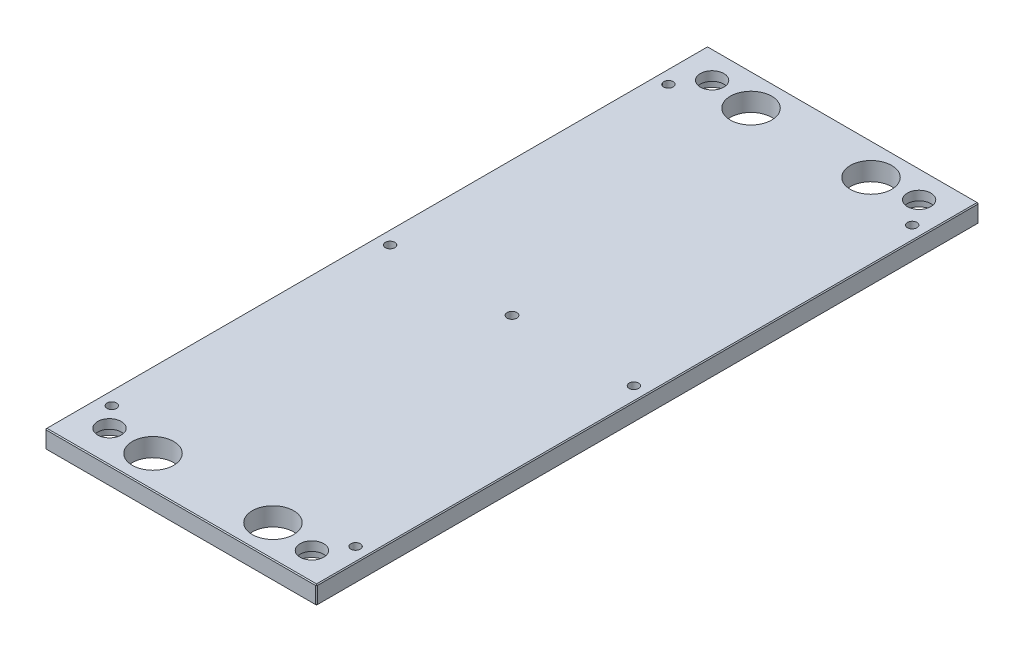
ISO-10303-21;
HEADER;
FILE_DESCRIPTION(('STEP AP214'),'2;1');
FILE_NAME('part.step','',(''),(''),'','','');
FILE_SCHEMA(('AUTOMOTIVE_DESIGN { 1 0 10303 214 1 1 1 1 }'));
ENDSEC;
DATA;
#1=APPLICATION_CONTEXT('core data for automotive mechanical design processes');
#2=APPLICATION_PROTOCOL_DEFINITION('international standard','automotive_design',2000,#1);
#3=PRODUCT_CONTEXT('',#1,'mechanical');
#4=PRODUCT('Part','Part','',(#3));
#5=PRODUCT_RELATED_PRODUCT_CATEGORY('part','',(#4));
#6=PRODUCT_DEFINITION_FORMATION('','',#4);
#7=PRODUCT_DEFINITION_CONTEXT('part definition',#1,'design');
#8=PRODUCT_DEFINITION('design','',#6,#7);
#9=PRODUCT_DEFINITION_SHAPE('','',#8);
#10=(LENGTH_UNIT() NAMED_UNIT(*) SI_UNIT(.MILLI.,.METRE.));
#11=(NAMED_UNIT(*) PLANE_ANGLE_UNIT() SI_UNIT($,.RADIAN.));
#12=(NAMED_UNIT(*) SI_UNIT($,.STERADIAN.) SOLID_ANGLE_UNIT());
#13=UNCERTAINTY_MEASURE_WITH_UNIT(LENGTH_MEASURE(1.E-05),#10,'distance_accuracy_value','');
#14=(GEOMETRIC_REPRESENTATION_CONTEXT(3) GLOBAL_UNCERTAINTY_ASSIGNED_CONTEXT((#13)) GLOBAL_UNIT_ASSIGNED_CONTEXT((#10,
#11,#12)) REPRESENTATION_CONTEXT('',''));
#15=CARTESIAN_POINT('',(0.,0.,0.));
#16=DIRECTION('',(0.,0.,1.));
#17=DIRECTION('',(1.,0.,0.));
#18=AXIS2_PLACEMENT_3D('',#15,#16,#17);
#19=CARTESIAN_POINT('',(-93.6625,-12.7,228.6));
#20=DIRECTION('',(0.,1.,0.));
#21=DIRECTION('',(-1.,0.,0.));
#22=AXIS2_PLACEMENT_3D('',#19,#20,#21);
#23=PLANE('',#22);
#24=CARTESIAN_POINT('',(-84.1375,-12.7000000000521,0.));
#25=DIRECTION('',(0.,1.,0.));
#26=DIRECTION('',(-1.,0.,0.));
#27=AXIS2_PLACEMENT_3D('',#24,#25,#26);
#28=CIRCLE('',#27,3.26389999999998);
#29=CARTESIAN_POINT('',(-87.4014,-12.7000000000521,0.));
#30=VERTEX_POINT('',#29);
#31=EDGE_CURVE('E900',#30,#30,#28,.T.);
#32=ORIENTED_EDGE('',*,*,#31,.F.);
#33=EDGE_LOOP('',(#32));
#34=FACE_BOUND('',#33,.T.);
#35=CARTESIAN_POINT('',(84.1375,-12.6999999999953,0.));
#36=DIRECTION('',(0.,1.,0.));
#37=DIRECTION('',(-1.,0.,0.));
#38=AXIS2_PLACEMENT_3D('',#35,#36,#37);
#39=CIRCLE('',#38,3.26389999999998);
#40=CARTESIAN_POINT('',(80.8736,-12.6999999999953,0.));
#41=VERTEX_POINT('',#40);
#42=EDGE_CURVE('E902',#41,#41,#39,.T.);
#43=ORIENTED_EDGE('',*,*,#42,.F.);
#44=EDGE_LOOP('',(#43));
#45=FACE_BOUND('',#44,.T.);
#46=CARTESIAN_POINT('',(-41.402,-12.6999999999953,-206.375));
#47=DIRECTION('',(0.,1.,0.));
#48=DIRECTION('',(-1.,0.,0.));
#49=AXIS2_PLACEMENT_3D('',#46,#47,#48);
#50=CIRCLE('',#49,14.2875);
#51=CARTESIAN_POINT('',(-55.6895,-12.6999999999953,-206.375));
#52=VERTEX_POINT('',#51);
#53=EDGE_CURVE('E908',#52,#52,#50,.T.);
#54=ORIENTED_EDGE('',*,*,#53,.F.);
#55=EDGE_LOOP('',(#54));
#56=FACE_BOUND('',#55,.T.);
#57=CARTESIAN_POINT('',(-41.402,-12.7000000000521,206.375));
#58=DIRECTION('',(0.,1.,0.));
#59=DIRECTION('',(-1.,0.,0.));
#60=AXIS2_PLACEMENT_3D('',#57,#58,#59);
#61=CIRCLE('',#60,14.2875);
#62=CARTESIAN_POINT('',(-55.6895,-12.7000000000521,206.375));
#63=VERTEX_POINT('',#62);
#64=EDGE_CURVE('E914',#63,#63,#61,.T.);
#65=ORIENTED_EDGE('',*,*,#64,.F.);
#66=EDGE_LOOP('',(#65));
#67=FACE_BOUND('',#66,.T.);
#68=CARTESIAN_POINT('',(41.402,-12.7000000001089,206.375));
#69=DIRECTION('',(0.,1.,0.));
#70=DIRECTION('',(-1.,0.,0.));
#71=AXIS2_PLACEMENT_3D('',#68,#69,#70);
#72=CIRCLE('',#71,14.2875);
#73=CARTESIAN_POINT('',(27.1145,-12.7000000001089,206.375));
#74=VERTEX_POINT('',#73);
#75=EDGE_CURVE('E920',#74,#74,#72,.T.);
#76=ORIENTED_EDGE('',*,*,#75,.F.);
#77=EDGE_LOOP('',(#76));
#78=FACE_BOUND('',#77,.T.);
#79=CARTESIAN_POINT('',(41.402,-12.7,-206.375));
#80=DIRECTION('',(0.,1.,0.));
#81=DIRECTION('',(-1.,0.,0.));
#82=AXIS2_PLACEMENT_3D('',#79,#80,#81);
#83=CIRCLE('',#82,14.2875);
#84=CARTESIAN_POINT('',(27.1144999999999,-12.7,-206.375));
#85=VERTEX_POINT('',#84);
#86=EDGE_CURVE('E926',#85,#85,#83,.T.);
#87=ORIENTED_EDGE('',*,*,#86,.F.);
#88=EDGE_LOOP('',(#87));
#89=FACE_BOUND('',#88,.T.);
#90=DIRECTION('',(0.,0.,-1.));
#91=VECTOR('',#90,1.);
#92=CARTESIAN_POINT('',(93.0275,-12.7,-228.6));
#93=LINE('',#92,#91);
#94=CARTESIAN_POINT('',(93.0275,-12.7,227.965));
#95=VERTEX_POINT('',#94);
#96=CARTESIAN_POINT('',(93.0275,-12.7,-227.965));
#97=VERTEX_POINT('',#96);
#98=EDGE_CURVE('E184',#95,#97,#93,.T.);
#99=ORIENTED_EDGE('',*,*,#98,.T.);
#100=DIRECTION('',(-1.,0.,0.));
#101=VECTOR('',#100,1.);
#102=CARTESIAN_POINT('',(-93.6625,-12.7,-227.965));
#103=LINE('',#102,#101);
#104=CARTESIAN_POINT('',(-93.0275,-12.7,-227.965));
#105=VERTEX_POINT('',#104);
#106=EDGE_CURVE('E146',#97,#105,#103,.T.);
#107=ORIENTED_EDGE('',*,*,#106,.T.);
#108=DIRECTION('',(0.,0.,1.));
#109=VECTOR('',#108,1.);
#110=CARTESIAN_POINT('',(-93.0275,-12.7,228.6));
#111=LINE('',#110,#109);
#112=CARTESIAN_POINT('',(-93.0275,-12.7,227.965));
#113=VERTEX_POINT('',#112);
#114=EDGE_CURVE('E186',#105,#113,#111,.T.);
#115=ORIENTED_EDGE('',*,*,#114,.T.);
#116=DIRECTION('',(1.,0.,0.));
#117=VECTOR('',#116,1.);
#118=CARTESIAN_POINT('',(-93.6625,-12.7,227.965));
#119=LINE('',#118,#117);
#120=EDGE_CURVE('E182',#113,#95,#119,.T.);
#121=ORIENTED_EDGE('',*,*,#120,.T.);
#122=EDGE_LOOP('',(#99,#107,#115,#121));
#123=FACE_BOUND('',#122,.T.);
#124=CARTESIAN_POINT('',(-84.1375,-12.6999999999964,-192.0875));
#125=DIRECTION('',(0.,1.,0.));
#126=DIRECTION('',(-1.,0.,0.));
#127=AXIS2_PLACEMENT_3D('',#124,#125,#126);
#128=CIRCLE('',#127,3.26390000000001);
#129=CARTESIAN_POINT('',(-87.4014,-12.6999999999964,-192.0875));
#130=VERTEX_POINT('',#129);
#131=EDGE_CURVE('E267',#130,#130,#128,.T.);
#132=ORIENTED_EDGE('',*,*,#131,.F.);
#133=EDGE_LOOP('',(#132));
#134=FACE_BOUND('',#133,.T.);
#135=CARTESIAN_POINT('',(-84.1375,-12.7000000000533,192.0875));
#136=DIRECTION('',(0.,1.,0.));
#137=DIRECTION('',(-1.,0.,0.));
#138=AXIS2_PLACEMENT_3D('',#135,#136,#137);
#139=CIRCLE('',#138,3.26389999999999);
#140=CARTESIAN_POINT('',(-87.4014,-12.7000000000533,192.0875));
#141=VERTEX_POINT('',#140);
#142=EDGE_CURVE('E278',#141,#141,#139,.T.);
#143=ORIENTED_EDGE('',*,*,#142,.F.);
#144=EDGE_LOOP('',(#143));
#145=FACE_BOUND('',#144,.T.);
#146=CARTESIAN_POINT('',(84.1375,-12.6999999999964,192.0875));
#147=DIRECTION('',(0.,1.,0.));
#148=DIRECTION('',(-1.,0.,0.));
#149=AXIS2_PLACEMENT_3D('',#146,#147,#148);
#150=CIRCLE('',#149,3.26390000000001);
#151=CARTESIAN_POINT('',(80.8736,-12.6999999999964,192.0875));
#152=VERTEX_POINT('',#151);
#153=EDGE_CURVE('E285',#152,#152,#150,.T.);
#154=ORIENTED_EDGE('',*,*,#153,.F.);
#155=EDGE_LOOP('',(#154));
#156=FACE_BOUND('',#155,.T.);
#157=CARTESIAN_POINT('',(84.1375,-12.7,-192.0875));
#158=DIRECTION('',(0.,1.,0.));
#159=DIRECTION('',(-1.,0.,0.));
#160=AXIS2_PLACEMENT_3D('',#157,#158,#159);
#161=CIRCLE('',#160,3.26389999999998);
#162=CARTESIAN_POINT('',(80.8736,-12.7,-192.0875));
#163=VERTEX_POINT('',#162);
#164=EDGE_CURVE('E291',#163,#163,#161,.T.);
#165=ORIENTED_EDGE('',*,*,#164,.F.);
#166=EDGE_LOOP('',(#165));
#167=FACE_BOUND('',#166,.T.);
#168=CARTESIAN_POINT('',(-71.4375,-12.6999999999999,-209.55));
#169=DIRECTION('',(0.,-1.,0.));
#170=DIRECTION('',(0.,0.,-1.));
#171=AXIS2_PLACEMENT_3D('',#168,#169,#170);
#172=CIRCLE('',#171,8.13593749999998);
#173=CARTESIAN_POINT('',(-71.4375,-12.6999999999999,-217.6859375));
#174=VERTEX_POINT('',#173);
#175=EDGE_CURVE('E311',#174,#174,#172,.T.);
#176=ORIENTED_EDGE('',*,*,#175,.T.);
#177=EDGE_LOOP('',(#176));
#178=FACE_BOUND('',#177,.T.);
#179=CARTESIAN_POINT('',(71.4375,-12.7,209.55));
#180=DIRECTION('',(0.,-1.,0.));
#181=DIRECTION('',(0.,0.,-1.));
#182=AXIS2_PLACEMENT_3D('',#179,#180,#181);
#183=CIRCLE('',#182,8.13593749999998);
#184=CARTESIAN_POINT('',(71.4375,-12.7,201.4140625));
#185=VERTEX_POINT('',#184);
#186=EDGE_CURVE('E335',#185,#185,#183,.T.);
#187=ORIENTED_EDGE('',*,*,#186,.T.);
#188=EDGE_LOOP('',(#187));
#189=FACE_BOUND('',#188,.T.);
#190=CARTESIAN_POINT('',(71.4375,-12.7,-209.55));
#191=DIRECTION('',(0.,-1.,0.));
#192=DIRECTION('',(0.,0.,-1.));
#193=AXIS2_PLACEMENT_3D('',#190,#191,#192);
#194=CIRCLE('',#193,8.13593749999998);
#195=CARTESIAN_POINT('',(71.4375,-12.7,-217.6859375));
#196=VERTEX_POINT('',#195);
#197=EDGE_CURVE('E347',#196,#196,#194,.T.);
#198=ORIENTED_EDGE('',*,*,#197,.T.);
#199=EDGE_LOOP('',(#198));
#200=FACE_BOUND('',#199,.T.);
#201=CARTESIAN_POINT('',(-71.4375,-12.6999999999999,206.375));
#202=DIRECTION('',(0.,-1.,0.));
#203=DIRECTION('',(0.,0.,-1.));
#204=AXIS2_PLACEMENT_3D('',#201,#202,#203);
#205=CIRCLE('',#204,8.13593749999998);
#206=CARTESIAN_POINT('',(-71.4375,-12.6999999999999,198.2390625));
#207=VERTEX_POINT('',#206);
#208=EDGE_CURVE('E323',#207,#207,#205,.T.);
#209=ORIENTED_EDGE('',*,*,#208,.T.);
#210=EDGE_LOOP('',(#209));
#211=FACE_BOUND('',#210,.T.);
#212=CARTESIAN_POINT('',(0.,-12.6999999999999,0.));
#213=DIRECTION('',(0.,-1.,0.));
#214=DIRECTION('',(0.,0.,-1.));
#215=AXIS2_PLACEMENT_3D('',#212,#213,#214);
#216=CIRCLE('',#215,3.37343749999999);
#217=CARTESIAN_POINT('',(0.,-12.6999999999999,-3.37343749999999));
#218=VERTEX_POINT('',#217);
#219=EDGE_CURVE('E297',#218,#218,#216,.T.);
#220=ORIENTED_EDGE('',*,*,#219,.T.);
#221=EDGE_LOOP('',(#220));
#222=FACE_BOUND('',#221,.T.);
#223=ADVANCED_FACE('F39',(#34,#45,#56,#67,#78,#89,#123,#134,#145,#156,#167,#178,#189,#200,#211,
#222),#23,.T.);
#224=CARTESIAN_POINT('',(93.6625,-25.4,228.6));
#225=DIRECTION('',(0.,-1.,0.));
#226=DIRECTION('',(1.,0.,0.));
#227=AXIS2_PLACEMENT_3D('',#224,#225,#226);
#228=PLANE('',#227);
#229=CARTESIAN_POINT('',(-84.1375,-25.4,0.));
#230=DIRECTION('',(0.,1.,0.));
#231=DIRECTION('',(-1.,0.,0.));
#232=AXIS2_PLACEMENT_3D('',#229,#230,#231);
#233=CIRCLE('',#232,3.26389999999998);
#234=CARTESIAN_POINT('',(-87.4014,-25.4,0.));
#235=VERTEX_POINT('',#234);
#236=EDGE_CURVE('E898',#235,#235,#233,.T.);
#237=ORIENTED_EDGE('',*,*,#236,.T.);
#238=EDGE_LOOP('',(#237));
#239=FACE_BOUND('',#238,.T.);
#240=CARTESIAN_POINT('',(84.1375,-25.4,0.));
#241=DIRECTION('',(0.,1.,0.));
#242=DIRECTION('',(-1.,0.,0.));
#243=AXIS2_PLACEMENT_3D('',#240,#241,#242);
#244=CIRCLE('',#243,3.26389999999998);
#245=CARTESIAN_POINT('',(80.8736,-25.4,0.));
#246=VERTEX_POINT('',#245);
#247=EDGE_CURVE('E905',#246,#246,#244,.T.);
#248=ORIENTED_EDGE('',*,*,#247,.T.);
#249=EDGE_LOOP('',(#248));
#250=FACE_BOUND('',#249,.T.);
#251=CARTESIAN_POINT('',(-41.402,-25.4,-206.375));
#252=DIRECTION('',(0.,1.,0.));
#253=DIRECTION('',(-1.,0.,0.));
#254=AXIS2_PLACEMENT_3D('',#251,#252,#253);
#255=CIRCLE('',#254,14.2875);
#256=CARTESIAN_POINT('',(-55.6895,-25.4,-206.375));
#257=VERTEX_POINT('',#256);
#258=EDGE_CURVE('E911',#257,#257,#255,.T.);
#259=ORIENTED_EDGE('',*,*,#258,.T.);
#260=EDGE_LOOP('',(#259));
#261=FACE_BOUND('',#260,.T.);
#262=CARTESIAN_POINT('',(-41.402,-25.4,206.375));
#263=DIRECTION('',(0.,1.,0.));
#264=DIRECTION('',(-1.,0.,0.));
#265=AXIS2_PLACEMENT_3D('',#262,#263,#264);
#266=CIRCLE('',#265,14.2875);
#267=CARTESIAN_POINT('',(-55.6895,-25.4,206.375));
#268=VERTEX_POINT('',#267);
#269=EDGE_CURVE('E917',#268,#268,#266,.T.);
#270=ORIENTED_EDGE('',*,*,#269,.T.);
#271=EDGE_LOOP('',(#270));
#272=FACE_BOUND('',#271,.T.);
#273=CARTESIAN_POINT('',(41.402,-25.4,206.375));
#274=DIRECTION('',(0.,1.,0.));
#275=DIRECTION('',(-1.,0.,0.));
#276=AXIS2_PLACEMENT_3D('',#273,#274,#275);
#277=CIRCLE('',#276,14.2875);
#278=CARTESIAN_POINT('',(27.1145,-25.4,206.375));
#279=VERTEX_POINT('',#278);
#280=EDGE_CURVE('E923',#279,#279,#277,.T.);
#281=ORIENTED_EDGE('',*,*,#280,.T.);
#282=EDGE_LOOP('',(#281));
#283=FACE_BOUND('',#282,.T.);
#284=CARTESIAN_POINT('',(41.402,-25.4,-206.375));
#285=DIRECTION('',(0.,1.,0.));
#286=DIRECTION('',(-1.,0.,0.));
#287=AXIS2_PLACEMENT_3D('',#284,#285,#286);
#288=CIRCLE('',#287,14.2875);
#289=CARTESIAN_POINT('',(27.1144999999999,-25.4,-206.375));
#290=VERTEX_POINT('',#289);
#291=EDGE_CURVE('E214',#290,#290,#288,.T.);
#292=ORIENTED_EDGE('',*,*,#291,.T.);
#293=EDGE_LOOP('',(#292));
#294=FACE_BOUND('',#293,.T.);
#295=DIRECTION('',(0.,0.,-1.));
#296=VECTOR('',#295,1.);
#297=CARTESIAN_POINT('',(-93.0275,-25.4,-228.6));
#298=LINE('',#297,#296);
#299=CARTESIAN_POINT('',(-93.0275,-25.4,227.965));
#300=VERTEX_POINT('',#299);
#301=CARTESIAN_POINT('',(-93.0275,-25.4,-227.965));
#302=VERTEX_POINT('',#301);
#303=EDGE_CURVE('E177',#300,#302,#298,.T.);
#304=ORIENTED_EDGE('',*,*,#303,.T.);
#305=DIRECTION('',(1.,0.,0.));
#306=VECTOR('',#305,1.);
#307=CARTESIAN_POINT('',(93.6625,-25.4,-227.965));
#308=LINE('',#307,#306);
#309=CARTESIAN_POINT('',(93.0275,-25.4,-227.965));
#310=VERTEX_POINT('',#309);
#311=EDGE_CURVE('E179',#302,#310,#308,.T.);
#312=ORIENTED_EDGE('',*,*,#311,.T.);
#313=DIRECTION('',(0.,0.,1.));
#314=VECTOR('',#313,1.);
#315=CARTESIAN_POINT('',(93.0275,-25.4,228.6));
#316=LINE('',#315,#314);
#317=CARTESIAN_POINT('',(93.0275,-25.4,227.965));
#318=VERTEX_POINT('',#317);
#319=EDGE_CURVE('E175',#310,#318,#316,.T.);
#320=ORIENTED_EDGE('',*,*,#319,.T.);
#321=DIRECTION('',(-1.,0.,0.));
#322=VECTOR('',#321,1.);
#323=CARTESIAN_POINT('',(93.6625,-25.4,227.965));
#324=LINE('',#323,#322);
#325=EDGE_CURVE('E173',#318,#300,#324,.T.);
#326=ORIENTED_EDGE('',*,*,#325,.T.);
#327=EDGE_LOOP('',(#304,#312,#320,#326));
#328=FACE_BOUND('',#327,.T.);
#329=CARTESIAN_POINT('',(-84.1375,-25.4,-192.0875));
#330=DIRECTION('',(0.,1.,0.));
#331=DIRECTION('',(-1.,0.,0.));
#332=AXIS2_PLACEMENT_3D('',#329,#330,#331);
#333=CIRCLE('',#332,3.26390000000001);
#334=CARTESIAN_POINT('',(-87.4014,-25.4,-192.0875));
#335=VERTEX_POINT('',#334);
#336=EDGE_CURVE('E273',#335,#335,#333,.T.);
#337=ORIENTED_EDGE('',*,*,#336,.T.);
#338=EDGE_LOOP('',(#337));
#339=FACE_BOUND('',#338,.T.);
#340=CARTESIAN_POINT('',(-84.1375,-25.4,192.0875));
#341=DIRECTION('',(0.,1.,0.));
#342=DIRECTION('',(-1.,0.,0.));
#343=AXIS2_PLACEMENT_3D('',#340,#341,#342);
#344=CIRCLE('',#343,3.26389999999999);
#345=CARTESIAN_POINT('',(-87.4014,-25.4,192.0875));
#346=VERTEX_POINT('',#345);
#347=EDGE_CURVE('E282',#346,#346,#344,.T.);
#348=ORIENTED_EDGE('',*,*,#347,.T.);
#349=EDGE_LOOP('',(#348));
#350=FACE_BOUND('',#349,.T.);
#351=CARTESIAN_POINT('',(84.1375,-25.4,192.0875));
#352=DIRECTION('',(0.,1.,0.));
#353=DIRECTION('',(-1.,0.,0.));
#354=AXIS2_PLACEMENT_3D('',#351,#352,#353);
#355=CIRCLE('',#354,3.26390000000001);
#356=CARTESIAN_POINT('',(80.8736,-25.4,192.0875));
#357=VERTEX_POINT('',#356);
#358=EDGE_CURVE('E288',#357,#357,#355,.T.);
#359=ORIENTED_EDGE('',*,*,#358,.T.);
#360=EDGE_LOOP('',(#359));
#361=FACE_BOUND('',#360,.T.);
#362=CARTESIAN_POINT('',(84.1375,-25.4,-192.0875));
#363=DIRECTION('',(0.,1.,0.));
#364=DIRECTION('',(-1.,0.,0.));
#365=AXIS2_PLACEMENT_3D('',#362,#363,#364);
#366=CIRCLE('',#365,3.26389999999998);
#367=CARTESIAN_POINT('',(80.8736,-25.4,-192.0875));
#368=VERTEX_POINT('',#367);
#369=EDGE_CURVE('E294',#368,#368,#366,.T.);
#370=ORIENTED_EDGE('',*,*,#369,.T.);
#371=EDGE_LOOP('',(#370));
#372=FACE_BOUND('',#371,.T.);
#373=CARTESIAN_POINT('',(-71.4375,-25.4,-209.55));
#374=DIRECTION('',(0.,-1.,0.));
#375=DIRECTION('',(0.,0.,-1.));
#376=AXIS2_PLACEMENT_3D('',#373,#374,#375);
#377=CIRCLE('',#376,11.90625);
#378=CARTESIAN_POINT('',(-71.4375,-25.4,-221.45625));
#379=VERTEX_POINT('',#378);
#380=EDGE_CURVE('E320',#379,#379,#377,.T.);
#381=ORIENTED_EDGE('',*,*,#380,.F.);
#382=EDGE_LOOP('',(#381));
#383=FACE_BOUND('',#382,.T.);
#384=CARTESIAN_POINT('',(71.4375,-25.4,209.55));
#385=DIRECTION('',(0.,-1.,0.));
#386=DIRECTION('',(0.,0.,-1.));
#387=AXIS2_PLACEMENT_3D('',#384,#385,#386);
#388=CIRCLE('',#387,11.90625);
#389=CARTESIAN_POINT('',(71.4375,-25.4,197.64375));
#390=VERTEX_POINT('',#389);
#391=EDGE_CURVE('E344',#390,#390,#388,.T.);
#392=ORIENTED_EDGE('',*,*,#391,.F.);
#393=EDGE_LOOP('',(#392));
#394=FACE_BOUND('',#393,.T.);
#395=CARTESIAN_POINT('',(71.4375,-25.4,-209.55));
#396=DIRECTION('',(0.,-1.,0.));
#397=DIRECTION('',(0.,0.,-1.));
#398=AXIS2_PLACEMENT_3D('',#395,#396,#397);
#399=CIRCLE('',#398,11.90625);
#400=CARTESIAN_POINT('',(71.4375,-25.4,-221.45625));
#401=VERTEX_POINT('',#400);
#402=EDGE_CURVE('E164',#401,#401,#399,.T.);
#403=ORIENTED_EDGE('',*,*,#402,.F.);
#404=EDGE_LOOP('',(#403));
#405=FACE_BOUND('',#404,.T.);
#406=CARTESIAN_POINT('',(-71.4375,-25.4,206.375));
#407=DIRECTION('',(0.,-1.,0.));
#408=DIRECTION('',(0.,0.,-1.));
#409=AXIS2_PLACEMENT_3D('',#406,#407,#408);
#410=CIRCLE('',#409,11.90625);
#411=CARTESIAN_POINT('',(-71.4375,-25.4,194.46875));
#412=VERTEX_POINT('',#411);
#413=EDGE_CURVE('E332',#412,#412,#410,.T.);
#414=ORIENTED_EDGE('',*,*,#413,.F.);
#415=EDGE_LOOP('',(#414));
#416=FACE_BOUND('',#415,.T.);
#417=CARTESIAN_POINT('',(0.,-25.4,0.));
#418=DIRECTION('',(0.,-1.,0.));
#419=DIRECTION('',(0.,0.,-1.));
#420=AXIS2_PLACEMENT_3D('',#417,#418,#419);
#421=CIRCLE('',#420,6.34999999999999);
#422=CARTESIAN_POINT('',(0.,-25.4,-6.34999999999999));
#423=VERTEX_POINT('',#422);
#424=EDGE_CURVE('E308',#423,#423,#421,.T.);
#425=ORIENTED_EDGE('',*,*,#424,.F.);
#426=EDGE_LOOP('',(#425));
#427=FACE_BOUND('',#426,.T.);
#428=ADVANCED_FACE('F372',(#239,#250,#261,#272,#283,#294,#328,#339,#350,#361,#372,#383,#394,
#405,#416,#427),#228,.T.);
#429=CARTESIAN_POINT('',(-93.6625,-12.7,228.6));
#430=DIRECTION('',(1.,0.,0.));
#431=DIRECTION('',(0.,0.,-1.));
#432=AXIS2_PLACEMENT_3D('',#429,#430,#431);
#433=PLANE('',#432);
#434=DIRECTION('',(0.,0.,-1.));
#435=VECTOR('',#434,1.);
#436=CARTESIAN_POINT('',(-93.6625,-13.335,-228.6));
#437=LINE('',#436,#435);
#438=CARTESIAN_POINT('',(-93.6625,-13.335,227.965));
#439=VERTEX_POINT('',#438);
#440=CARTESIAN_POINT('',(-93.6625,-13.335,-227.965));
#441=VERTEX_POINT('',#440);
#442=EDGE_CURVE('E193',#439,#441,#437,.T.);
#443=ORIENTED_EDGE('',*,*,#442,.T.);
#444=DIRECTION('',(0.,-1.,0.));
#445=VECTOR('',#444,1.);
#446=CARTESIAN_POINT('',(-93.6625,-12.7,-227.965));
#447=LINE('',#446,#445);
#448=CARTESIAN_POINT('',(-93.6625,-24.765,-227.965));
#449=VERTEX_POINT('',#448);
#450=EDGE_CURVE('E196',#441,#449,#447,.T.);
#451=ORIENTED_EDGE('',*,*,#450,.T.);
#452=DIRECTION('',(0.,0.,1.));
#453=VECTOR('',#452,1.);
#454=CARTESIAN_POINT('',(-93.6625,-24.765,228.6));
#455=LINE('',#454,#453);
#456=CARTESIAN_POINT('',(-93.6625,-24.765,227.965));
#457=VERTEX_POINT('',#456);
#458=EDGE_CURVE('E191',#449,#457,#455,.T.);
#459=ORIENTED_EDGE('',*,*,#458,.T.);
#460=DIRECTION('',(0.,1.,0.));
#461=VECTOR('',#460,1.);
#462=CARTESIAN_POINT('',(-93.6625,-12.7,227.965));
#463=LINE('',#462,#461);
#464=EDGE_CURVE('E189',#457,#439,#463,.T.);
#465=ORIENTED_EDGE('',*,*,#464,.T.);
#466=EDGE_LOOP('',(#443,#451,#459,#465));
#467=FACE_BOUND('',#466,.T.);
#468=ADVANCED_FACE('F378',(#467),#433,.F.);
#469=CARTESIAN_POINT('',(93.6625,-25.4,228.6));
#470=DIRECTION('',(-1.,0.,0.));
#471=DIRECTION('',(0.,0.,1.));
#472=AXIS2_PLACEMENT_3D('',#469,#470,#471);
#473=PLANE('',#472);
#474=DIRECTION('',(0.,0.,-1.));
#475=VECTOR('',#474,1.);
#476=CARTESIAN_POINT('',(93.6625,-24.765,-228.6));
#477=LINE('',#476,#475);
#478=CARTESIAN_POINT('',(93.6625,-24.765,227.965));
#479=VERTEX_POINT('',#478);
#480=CARTESIAN_POINT('',(93.6625,-24.765,-227.965));
#481=VERTEX_POINT('',#480);
#482=EDGE_CURVE('E202',#479,#481,#477,.T.);
#483=ORIENTED_EDGE('',*,*,#482,.T.);
#484=DIRECTION('',(0.,1.,0.));
#485=VECTOR('',#484,1.);
#486=CARTESIAN_POINT('',(93.6625,-25.4,-227.965));
#487=LINE('',#486,#485);
#488=CARTESIAN_POINT('',(93.6625,-13.335,-227.965));
#489=VERTEX_POINT('',#488);
#490=EDGE_CURVE('E205',#481,#489,#487,.T.);
#491=ORIENTED_EDGE('',*,*,#490,.T.);
#492=DIRECTION('',(0.,0.,1.));
#493=VECTOR('',#492,1.);
#494=CARTESIAN_POINT('',(93.6625,-13.335,228.6));
#495=LINE('',#494,#493);
#496=CARTESIAN_POINT('',(93.6625,-13.335,227.965));
#497=VERTEX_POINT('',#496);
#498=EDGE_CURVE('E200',#489,#497,#495,.T.);
#499=ORIENTED_EDGE('',*,*,#498,.T.);
#500=DIRECTION('',(0.,-1.,0.));
#501=VECTOR('',#500,1.);
#502=CARTESIAN_POINT('',(93.6625,-25.4,227.965));
#503=LINE('',#502,#501);
#504=EDGE_CURVE('E198',#497,#479,#503,.T.);
#505=ORIENTED_EDGE('',*,*,#504,.T.);
#506=EDGE_LOOP('',(#483,#491,#499,#505));
#507=FACE_BOUND('',#506,.T.);
#508=ADVANCED_FACE('F384',(#507),#473,.F.);
#509=CARTESIAN_POINT('',(-93.6625,-12.7,228.6));
#510=DIRECTION('',(0.,0.,1.));
#511=DIRECTION('',(1.,0.,0.));
#512=AXIS2_PLACEMENT_3D('',#509,#510,#511);
#513=PLANE('',#512);
#514=DIRECTION('',(0.,1.,0.));
#515=VECTOR('',#514,1.);
#516=CARTESIAN_POINT('',(93.0275,-12.7,228.6));
#517=LINE('',#516,#515);
#518=CARTESIAN_POINT('',(93.0275,-24.765,228.6));
#519=VERTEX_POINT('',#518);
#520=CARTESIAN_POINT('',(93.0275,-13.335,228.6));
#521=VERTEX_POINT('',#520);
#522=EDGE_CURVE('E48',#519,#521,#517,.T.);
#523=ORIENTED_EDGE('',*,*,#522,.T.);
#524=DIRECTION('',(-1.,0.,0.));
#525=VECTOR('',#524,1.);
#526=CARTESIAN_POINT('',(-93.6625,-13.335,228.6));
#527=LINE('',#526,#525);
#528=CARTESIAN_POINT('',(-93.0275,-13.335,228.6));
#529=VERTEX_POINT('',#528);
#530=EDGE_CURVE('E11',#521,#529,#527,.T.);
#531=ORIENTED_EDGE('',*,*,#530,.T.);
#532=DIRECTION('',(0.,-1.,0.));
#533=VECTOR('',#532,1.);
#534=CARTESIAN_POINT('',(-93.0275,-25.4,228.6));
#535=LINE('',#534,#533);
#536=CARTESIAN_POINT('',(-93.0275,-24.7649999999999,228.6));
#537=VERTEX_POINT('',#536);
#538=EDGE_CURVE('E207',#529,#537,#535,.T.);
#539=ORIENTED_EDGE('',*,*,#538,.T.);
#540=DIRECTION('',(1.,0.,0.));
#541=VECTOR('',#540,1.);
#542=CARTESIAN_POINT('',(-93.6625,-24.7649999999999,228.6));
#543=LINE('',#542,#541);
#544=EDGE_CURVE('E59',#537,#519,#543,.T.);
#545=ORIENTED_EDGE('',*,*,#544,.T.);
#546=EDGE_LOOP('',(#523,#531,#539,#545));
#547=FACE_BOUND('',#546,.T.);
#548=ADVANCED_FACE('F368',(#547),#513,.T.);
#549=CARTESIAN_POINT('',(-93.6625,-12.7,-228.6));
#550=DIRECTION('',(0.,0.,1.));
#551=DIRECTION('',(1.,0.,0.));
#552=AXIS2_PLACEMENT_3D('',#549,#550,#551);
#553=PLANE('',#552);
#554=DIRECTION('',(-1.,0.,0.));
#555=VECTOR('',#554,1.);
#556=CARTESIAN_POINT('',(-93.6625,-24.7649999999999,-228.6));
#557=LINE('',#556,#555);
#558=CARTESIAN_POINT('',(93.0275,-24.765,-228.6));
#559=VERTEX_POINT('',#558);
#560=CARTESIAN_POINT('',(-93.0275,-24.7649999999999,-228.6));
#561=VERTEX_POINT('',#560);
#562=EDGE_CURVE('E138',#559,#561,#557,.T.);
#563=ORIENTED_EDGE('',*,*,#562,.T.);
#564=DIRECTION('',(0.,1.,0.));
#565=VECTOR('',#564,1.);
#566=CARTESIAN_POINT('',(-93.0275,-12.7,-228.6));
#567=LINE('',#566,#565);
#568=CARTESIAN_POINT('',(-93.0275,-13.335,-228.6));
#569=VERTEX_POINT('',#568);
#570=EDGE_CURVE('E134',#561,#569,#567,.T.);
#571=ORIENTED_EDGE('',*,*,#570,.T.);
#572=DIRECTION('',(1.,0.,0.));
#573=VECTOR('',#572,1.);
#574=CARTESIAN_POINT('',(93.6625,-13.335,-228.6));
#575=LINE('',#574,#573);
#576=CARTESIAN_POINT('',(93.0275,-13.335,-228.6));
#577=VERTEX_POINT('',#576);
#578=EDGE_CURVE('E126',#569,#577,#575,.T.);
#579=ORIENTED_EDGE('',*,*,#578,.T.);
#580=DIRECTION('',(0.,-1.,0.));
#581=VECTOR('',#580,1.);
#582=CARTESIAN_POINT('',(93.0275,-12.7,-228.6));
#583=LINE('',#582,#581);
#584=EDGE_CURVE('E131',#577,#559,#583,.T.);
#585=ORIENTED_EDGE('',*,*,#584,.T.);
#586=EDGE_LOOP('',(#563,#571,#579,#585));
#587=FACE_BOUND('',#586,.T.);
#588=ADVANCED_FACE('F129',(#587),#553,.F.);
#589=CARTESIAN_POINT('',(71.4375,-25.4,-209.55));
#590=DIRECTION('',(0.,-1.,0.));
#591=DIRECTION('',(0.,0.,-1.));
#592=AXIS2_PLACEMENT_3D('',#589,#590,#591);
#593=CYLINDRICAL_SURFACE('',#592,11.90625);
#594=ORIENTED_EDGE('',*,*,#402,.T.);
#595=EDGE_LOOP('',(#594));
#596=FACE_BOUND('',#595,.T.);
#597=CARTESIAN_POINT('',(71.4375,-19.05,-209.55));
#598=DIRECTION('',(0.,-1.,0.));
#599=DIRECTION('',(0.,0.,-1.));
#600=AXIS2_PLACEMENT_3D('',#597,#598,#599);
#601=CIRCLE('',#600,11.90625);
#602=CARTESIAN_POINT('',(71.4375,-19.05,-221.45625));
#603=VERTEX_POINT('',#602);
#604=EDGE_CURVE('E167',#603,#603,#601,.T.);
#605=ORIENTED_EDGE('',*,*,#604,.F.);
#606=EDGE_LOOP('',(#605));
#607=FACE_BOUND('',#606,.T.);
#608=ADVANCED_FACE('F358',(#596,#607),#593,.F.);
#609=CARTESIAN_POINT('',(79.5734375,-19.05,-209.55));
#610=DIRECTION('',(0.,-1.,0.));
#611=DIRECTION('',(0.,0.,-1.));
#612=AXIS2_PLACEMENT_3D('',#609,#610,#611);
#613=PLANE('',#612);
#614=ORIENTED_EDGE('',*,*,#604,.T.);
#615=EDGE_LOOP('',(#614));
#616=FACE_BOUND('',#615,.T.);
#617=CARTESIAN_POINT('',(71.4375,-19.05,-209.55));
#618=DIRECTION('',(0.,-1.,0.));
#619=DIRECTION('',(0.,0.,-1.));
#620=AXIS2_PLACEMENT_3D('',#617,#618,#619);
#621=CIRCLE('',#620,8.13593749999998);
#622=CARTESIAN_POINT('',(71.4375,-19.05,-217.6859375));
#623=VERTEX_POINT('',#622);
#624=EDGE_CURVE('E350',#623,#623,#621,.T.);
#625=ORIENTED_EDGE('',*,*,#624,.F.);
#626=EDGE_LOOP('',(#625));
#627=FACE_BOUND('',#626,.T.);
#628=ADVANCED_FACE('F355',(#616,#627),#613,.T.);
#629=CARTESIAN_POINT('',(71.4375,-25.4,-209.55));
#630=DIRECTION('',(0.,-1.,0.));
#631=DIRECTION('',(0.,0.,-1.));
#632=AXIS2_PLACEMENT_3D('',#629,#630,#631);
#633=CYLINDRICAL_SURFACE('',#632,8.13593749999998);
#634=ORIENTED_EDGE('',*,*,#624,.T.);
#635=EDGE_LOOP('',(#634));
#636=FACE_BOUND('',#635,.T.);
#637=ORIENTED_EDGE('',*,*,#197,.F.);
#638=EDGE_LOOP('',(#637));
#639=FACE_BOUND('',#638,.T.);
#640=ADVANCED_FACE('F366',(#636,#639),#633,.F.);
#641=CARTESIAN_POINT('',(71.4375,-25.4,209.55));
#642=DIRECTION('',(0.,-1.,0.));
#643=DIRECTION('',(0.,0.,-1.));
#644=AXIS2_PLACEMENT_3D('',#641,#642,#643);
#645=CYLINDRICAL_SURFACE('',#644,11.90625);
#646=ORIENTED_EDGE('',*,*,#391,.T.);
#647=EDGE_LOOP('',(#646));
#648=FACE_BOUND('',#647,.T.);
#649=CARTESIAN_POINT('',(71.4375,-19.05,209.55));
#650=DIRECTION('',(0.,-1.,0.));
#651=DIRECTION('',(0.,0.,-1.));
#652=AXIS2_PLACEMENT_3D('',#649,#650,#651);
#653=CIRCLE('',#652,11.90625);
#654=CARTESIAN_POINT('',(71.4375,-19.05,197.64375));
#655=VERTEX_POINT('',#654);
#656=EDGE_CURVE('E341',#655,#655,#653,.T.);
#657=ORIENTED_EDGE('',*,*,#656,.F.);
#658=EDGE_LOOP('',(#657));
#659=FACE_BOUND('',#658,.T.);
#660=ADVANCED_FACE('F569',(#648,#659),#645,.F.);
#661=CARTESIAN_POINT('',(79.5734375,-19.05,209.55));
#662=DIRECTION('',(0.,-1.,0.));
#663=DIRECTION('',(0.,0.,-1.));
#664=AXIS2_PLACEMENT_3D('',#661,#662,#663);
#665=PLANE('',#664);
#666=ORIENTED_EDGE('',*,*,#656,.T.);
#667=EDGE_LOOP('',(#666));
#668=FACE_BOUND('',#667,.T.);
#669=CARTESIAN_POINT('',(71.4375,-19.05,209.55));
#670=DIRECTION('',(0.,-1.,0.));
#671=DIRECTION('',(0.,0.,-1.));
#672=AXIS2_PLACEMENT_3D('',#669,#670,#671);
#673=CIRCLE('',#672,8.13593749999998);
#674=CARTESIAN_POINT('',(71.4375,-19.05,201.4140625));
#675=VERTEX_POINT('',#674);
#676=EDGE_CURVE('E338',#675,#675,#673,.T.);
#677=ORIENTED_EDGE('',*,*,#676,.F.);
#678=EDGE_LOOP('',(#677));
#679=FACE_BOUND('',#678,.T.);
#680=ADVANCED_FACE('F565',(#668,#679),#665,.T.);
#681=CARTESIAN_POINT('',(71.4375,-25.4,209.55));
#682=DIRECTION('',(0.,-1.,0.));
#683=DIRECTION('',(0.,0.,-1.));
#684=AXIS2_PLACEMENT_3D('',#681,#682,#683);
#685=CYLINDRICAL_SURFACE('',#684,8.13593749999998);
#686=ORIENTED_EDGE('',*,*,#676,.T.);
#687=EDGE_LOOP('',(#686));
#688=FACE_BOUND('',#687,.T.);
#689=ORIENTED_EDGE('',*,*,#186,.F.);
#690=EDGE_LOOP('',(#689));
#691=FACE_BOUND('',#690,.T.);
#692=ADVANCED_FACE('F561',(#688,#691),#685,.F.);
#693=CARTESIAN_POINT('',(-71.4375,-25.4,206.375));
#694=DIRECTION('',(0.,-1.,0.));
#695=DIRECTION('',(0.,0.,-1.));
#696=AXIS2_PLACEMENT_3D('',#693,#694,#695);
#697=CYLINDRICAL_SURFACE('',#696,11.90625);
#698=ORIENTED_EDGE('',*,*,#413,.T.);
#699=EDGE_LOOP('',(#698));
#700=FACE_BOUND('',#699,.T.);
#701=CARTESIAN_POINT('',(-71.4375,-19.05,206.375));
#702=DIRECTION('',(0.,-1.,0.));
#703=DIRECTION('',(0.,0.,-1.));
#704=AXIS2_PLACEMENT_3D('',#701,#702,#703);
#705=CIRCLE('',#704,11.90625);
#706=CARTESIAN_POINT('',(-71.4375,-19.05,194.46875));
#707=VERTEX_POINT('',#706);
#708=EDGE_CURVE('E329',#707,#707,#705,.T.);
#709=ORIENTED_EDGE('',*,*,#708,.F.);
#710=EDGE_LOOP('',(#709));
#711=FACE_BOUND('',#710,.T.);
#712=ADVANCED_FACE('F557',(#700,#711),#697,.F.);
#713=CARTESIAN_POINT('',(-63.3015625,-19.05,206.375));
#714=DIRECTION('',(0.,-1.,0.));
#715=DIRECTION('',(0.,0.,-1.));
#716=AXIS2_PLACEMENT_3D('',#713,#714,#715);
#717=PLANE('',#716);
#718=ORIENTED_EDGE('',*,*,#708,.T.);
#719=EDGE_LOOP('',(#718));
#720=FACE_BOUND('',#719,.T.);
#721=CARTESIAN_POINT('',(-71.4375,-19.05,206.375));
#722=DIRECTION('',(0.,-1.,0.));
#723=DIRECTION('',(0.,0.,-1.));
#724=AXIS2_PLACEMENT_3D('',#721,#722,#723);
#725=CIRCLE('',#724,8.13593749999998);
#726=CARTESIAN_POINT('',(-71.4375,-19.05,198.2390625));
#727=VERTEX_POINT('',#726);
#728=EDGE_CURVE('E326',#727,#727,#725,.T.);
#729=ORIENTED_EDGE('',*,*,#728,.F.);
#730=EDGE_LOOP('',(#729));
#731=FACE_BOUND('',#730,.T.);
#732=ADVANCED_FACE('F553',(#720,#731),#717,.T.);
#733=CARTESIAN_POINT('',(-71.4375,-25.4,206.375));
#734=DIRECTION('',(0.,-1.,0.));
#735=DIRECTION('',(0.,0.,-1.));
#736=AXIS2_PLACEMENT_3D('',#733,#734,#735);
#737=CYLINDRICAL_SURFACE('',#736,8.13593749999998);
#738=ORIENTED_EDGE('',*,*,#728,.T.);
#739=EDGE_LOOP('',(#738));
#740=FACE_BOUND('',#739,.T.);
#741=ORIENTED_EDGE('',*,*,#208,.F.);
#742=EDGE_LOOP('',(#741));
#743=FACE_BOUND('',#742,.T.);
#744=ADVANCED_FACE('F549',(#740,#743),#737,.F.);
#745=CARTESIAN_POINT('',(-71.4375,-25.4,-209.55));
#746=DIRECTION('',(0.,-1.,0.));
#747=DIRECTION('',(0.,0.,-1.));
#748=AXIS2_PLACEMENT_3D('',#745,#746,#747);
#749=CYLINDRICAL_SURFACE('',#748,11.90625);
#750=ORIENTED_EDGE('',*,*,#380,.T.);
#751=EDGE_LOOP('',(#750));
#752=FACE_BOUND('',#751,.T.);
#753=CARTESIAN_POINT('',(-71.4375,-19.05,-209.55));
#754=DIRECTION('',(0.,-1.,0.));
#755=DIRECTION('',(0.,0.,-1.));
#756=AXIS2_PLACEMENT_3D('',#753,#754,#755);
#757=CIRCLE('',#756,11.90625);
#758=CARTESIAN_POINT('',(-71.4375,-19.05,-221.45625));
#759=VERTEX_POINT('',#758);
#760=EDGE_CURVE('E317',#759,#759,#757,.T.);
#761=ORIENTED_EDGE('',*,*,#760,.F.);
#762=EDGE_LOOP('',(#761));
#763=FACE_BOUND('',#762,.T.);
#764=ADVANCED_FACE('F545',(#752,#763),#749,.F.);
#765=CARTESIAN_POINT('',(-63.3015625,-19.05,-209.55));
#766=DIRECTION('',(0.,-1.,0.));
#767=DIRECTION('',(0.,0.,-1.));
#768=AXIS2_PLACEMENT_3D('',#765,#766,#767);
#769=PLANE('',#768);
#770=ORIENTED_EDGE('',*,*,#760,.T.);
#771=EDGE_LOOP('',(#770));
#772=FACE_BOUND('',#771,.T.);
#773=CARTESIAN_POINT('',(-71.4375,-19.05,-209.55));
#774=DIRECTION('',(0.,-1.,0.));
#775=DIRECTION('',(0.,0.,-1.));
#776=AXIS2_PLACEMENT_3D('',#773,#774,#775);
#777=CIRCLE('',#776,8.13593749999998);
#778=CARTESIAN_POINT('',(-71.4375,-19.05,-217.6859375));
#779=VERTEX_POINT('',#778);
#780=EDGE_CURVE('E314',#779,#779,#777,.T.);
#781=ORIENTED_EDGE('',*,*,#780,.F.);
#782=EDGE_LOOP('',(#781));
#783=FACE_BOUND('',#782,.T.);
#784=ADVANCED_FACE('F541',(#772,#783),#769,.T.);
#785=CARTESIAN_POINT('',(-71.4375,-25.4,-209.55));
#786=DIRECTION('',(0.,-1.,0.));
#787=DIRECTION('',(0.,0.,-1.));
#788=AXIS2_PLACEMENT_3D('',#785,#786,#787);
#789=CYLINDRICAL_SURFACE('',#788,8.13593749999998);
#790=ORIENTED_EDGE('',*,*,#780,.T.);
#791=EDGE_LOOP('',(#790));
#792=FACE_BOUND('',#791,.T.);
#793=ORIENTED_EDGE('',*,*,#175,.F.);
#794=EDGE_LOOP('',(#793));
#795=FACE_BOUND('',#794,.T.);
#796=ADVANCED_FACE('F515',(#792,#795),#789,.F.);
#797=CARTESIAN_POINT('',(0.,-25.4,0.));
#798=DIRECTION('',(0.,-1.,0.));
#799=DIRECTION('',(0.,0.,-1.));
#800=AXIS2_PLACEMENT_3D('',#797,#798,#799);
#801=CYLINDRICAL_SURFACE('',#800,6.34999999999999);
#802=ORIENTED_EDGE('',*,*,#424,.T.);
#803=EDGE_LOOP('',(#802));
#804=FACE_BOUND('',#803,.T.);
#805=CARTESIAN_POINT('',(0.,-19.05,0.));
#806=DIRECTION('',(0.,-1.,0.));
#807=DIRECTION('',(0.,0.,-1.));
#808=AXIS2_PLACEMENT_3D('',#805,#806,#807);
#809=CIRCLE('',#808,6.34999999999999);
#810=CARTESIAN_POINT('',(0.,-19.05,-6.34999999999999));
#811=VERTEX_POINT('',#810);
#812=EDGE_CURVE('E305',#811,#811,#809,.T.);
#813=ORIENTED_EDGE('',*,*,#812,.F.);
#814=EDGE_LOOP('',(#813));
#815=FACE_BOUND('',#814,.T.);
#816=ADVANCED_FACE('F511',(#804,#815),#801,.F.);
#817=CARTESIAN_POINT('',(3.37343749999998,-19.05,0.));
#818=DIRECTION('',(0.,-1.,0.));
#819=DIRECTION('',(0.,0.,-1.));
#820=AXIS2_PLACEMENT_3D('',#817,#818,#819);
#821=PLANE('',#820);
#822=ORIENTED_EDGE('',*,*,#812,.T.);
#823=EDGE_LOOP('',(#822));
#824=FACE_BOUND('',#823,.T.);
#825=CARTESIAN_POINT('',(0.,-19.05,0.));
#826=DIRECTION('',(0.,-1.,0.));
#827=DIRECTION('',(0.,0.,-1.));
#828=AXIS2_PLACEMENT_3D('',#825,#826,#827);
#829=CIRCLE('',#828,3.37343749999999);
#830=CARTESIAN_POINT('',(0.,-19.05,-3.37343749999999));
#831=VERTEX_POINT('',#830);
#832=EDGE_CURVE('E302',#831,#831,#829,.T.);
#833=ORIENTED_EDGE('',*,*,#832,.F.);
#834=EDGE_LOOP('',(#833));
#835=FACE_BOUND('',#834,.T.);
#836=ADVANCED_FACE('F514',(#824,#835),#821,.T.);
#837=CARTESIAN_POINT('',(0.,-25.4,0.));
#838=DIRECTION('',(0.,-1.,0.));
#839=DIRECTION('',(0.,0.,-1.));
#840=AXIS2_PLACEMENT_3D('',#837,#838,#839);
#841=CYLINDRICAL_SURFACE('',#840,3.37343749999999);
#842=ORIENTED_EDGE('',*,*,#832,.T.);
#843=EDGE_LOOP('',(#842));
#844=FACE_BOUND('',#843,.T.);
#845=ORIENTED_EDGE('',*,*,#219,.F.);
#846=EDGE_LOOP('',(#845));
#847=FACE_BOUND('',#846,.T.);
#848=ADVANCED_FACE('F521',(#844,#847),#841,.F.);
#849=CARTESIAN_POINT('',(84.1375,-25.4,-192.0875));
#850=DIRECTION('',(0.,1.,0.));
#851=DIRECTION('',(-1.,0.,0.));
#852=AXIS2_PLACEMENT_3D('',#849,#850,#851);
#853=CYLINDRICAL_SURFACE('',#852,3.26389999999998);
#854=ORIENTED_EDGE('',*,*,#369,.F.);
#855=EDGE_LOOP('',(#854));
#856=FACE_BOUND('',#855,.T.);
#857=ORIENTED_EDGE('',*,*,#164,.T.);
#858=EDGE_LOOP('',(#857));
#859=FACE_BOUND('',#858,.T.);
#860=ADVANCED_FACE('F527',(#856,#859),#853,.F.);
#861=CARTESIAN_POINT('',(84.1375,-25.4,192.0875));
#862=DIRECTION('',(0.,1.,0.));
#863=DIRECTION('',(-1.,0.,0.));
#864=AXIS2_PLACEMENT_3D('',#861,#862,#863);
#865=CYLINDRICAL_SURFACE('',#864,3.26390000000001);
#866=CARTESIAN_POINT('',(80.8736,-25.4,192.0875));
#867=CARTESIAN_POINT('',(80.8736,-25.2677083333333,192.0875));
#868=CARTESIAN_POINT('',(80.8736,-25.1354166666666,192.0875));
#869=CARTESIAN_POINT('',(80.8736,-24.8708333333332,192.0875));
#870=CARTESIAN_POINT('',(80.8736,-24.7385416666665,192.0875));
#871=CARTESIAN_POINT('',(80.8736,-24.4739583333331,192.0875));
#872=CARTESIAN_POINT('',(80.8736,-24.3416666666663,192.0875));
#873=CARTESIAN_POINT('',(80.8736,-24.0770833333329,192.0875));
#874=CARTESIAN_POINT('',(80.8736,-23.9447916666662,192.0875));
#875=CARTESIAN_POINT('',(80.8736,-23.6802083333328,192.0875));
#876=CARTESIAN_POINT('',(80.8736,-23.5479166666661,192.0875));
#877=CARTESIAN_POINT('',(80.8736,-23.2833333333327,192.0875));
#878=CARTESIAN_POINT('',(80.8736,-23.151041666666,192.0875));
#879=CARTESIAN_POINT('',(80.8736,-22.8864583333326,192.0875));
#880=CARTESIAN_POINT('',(80.8736,-22.7541666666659,192.0875));
#881=CARTESIAN_POINT('',(80.8736,-22.4895833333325,192.0875));
#882=CARTESIAN_POINT('',(80.8736,-22.3572916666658,192.0875));
#883=CARTESIAN_POINT('',(80.8736,-22.0927083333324,192.0875));
#884=CARTESIAN_POINT('',(80.8736,-21.9604166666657,192.0875));
#885=CARTESIAN_POINT('',(80.8736,-21.6958333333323,192.0875));
#886=CARTESIAN_POINT('',(80.8736,-21.5635416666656,192.0875));
#887=CARTESIAN_POINT('',(80.8736,-21.2989583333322,192.0875));
#888=CARTESIAN_POINT('',(80.8736,-21.1666666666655,192.0875));
#889=CARTESIAN_POINT('',(80.8736,-20.9020833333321,192.0875));
#890=CARTESIAN_POINT('',(80.8736,-20.7697916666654,192.0875));
#891=CARTESIAN_POINT('',(80.8736,-20.5052083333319,192.0875));
#892=CARTESIAN_POINT('',(80.8736,-20.3729166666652,192.0875));
#893=CARTESIAN_POINT('',(80.8736,-20.1083333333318,192.0875));
#894=CARTESIAN_POINT('',(80.8736,-19.9760416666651,192.0875));
#895=CARTESIAN_POINT('',(80.8736,-19.7114583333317,192.0875));
#896=CARTESIAN_POINT('',(80.8736,-19.579166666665,192.0875));
#897=CARTESIAN_POINT('',(80.8736,-19.3145833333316,192.0875));
#898=CARTESIAN_POINT('',(80.8736,-19.1822916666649,192.0875));
#899=CARTESIAN_POINT('',(80.8736,-18.9177083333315,192.0875));
#900=CARTESIAN_POINT('',(80.8736,-18.7854166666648,192.0875));
#901=CARTESIAN_POINT('',(80.8736,-18.5208333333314,192.0875));
#902=CARTESIAN_POINT('',(80.8736,-18.3885416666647,192.0875));
#903=CARTESIAN_POINT('',(80.8736,-18.1239583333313,192.0875));
#904=CARTESIAN_POINT('',(80.8736,-17.9916666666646,192.0875));
#905=CARTESIAN_POINT('',(80.8736,-17.7270833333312,192.0875));
#906=CARTESIAN_POINT('',(80.8736,-17.5947916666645,192.0875));
#907=CARTESIAN_POINT('',(80.8736,-17.3302083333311,192.0875));
#908=CARTESIAN_POINT('',(80.8736,-17.1979166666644,192.0875));
#909=CARTESIAN_POINT('',(80.8736,-16.9333333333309,192.0875));
#910=CARTESIAN_POINT('',(80.8736,-16.8010416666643,192.0875));
#911=CARTESIAN_POINT('',(80.8736,-16.5364583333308,192.0875));
#912=CARTESIAN_POINT('',(80.8736,-16.4041666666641,192.0875));
#913=CARTESIAN_POINT('',(80.8736,-16.1395833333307,192.0875));
#914=CARTESIAN_POINT('',(80.8736,-16.007291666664,192.0875));
#915=CARTESIAN_POINT('',(80.8736,-15.7427083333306,192.0875));
#916=CARTESIAN_POINT('',(80.8736,-15.6104166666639,192.0875));
#917=CARTESIAN_POINT('',(80.8736,-15.3458333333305,192.0875));
#918=CARTESIAN_POINT('',(80.8736,-15.2135416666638,192.0875));
#919=CARTESIAN_POINT('',(80.8736,-14.9489583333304,192.0875));
#920=CARTESIAN_POINT('',(80.8736,-14.8166666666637,192.0875));
#921=CARTESIAN_POINT('',(80.8736,-14.5520833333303,192.0875));
#922=CARTESIAN_POINT('',(80.8736,-14.4197916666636,192.0875));
#923=CARTESIAN_POINT('',(80.8736,-14.1552083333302,192.0875));
#924=CARTESIAN_POINT('',(80.8736,-14.0229166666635,192.0875));
#925=CARTESIAN_POINT('',(80.8736,-13.7583333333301,192.0875));
#926=CARTESIAN_POINT('',(80.8736,-13.6260416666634,192.0875));
#927=CARTESIAN_POINT('',(80.8736,-13.36145833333,192.0875));
#928=CARTESIAN_POINT('',(80.8736,-13.2291666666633,192.0875));
#929=CARTESIAN_POINT('',(80.8736,-12.9645833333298,192.0875));
#930=CARTESIAN_POINT('',(80.8736,-12.8322916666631,192.0875));
#931=CARTESIAN_POINT('',(80.8736,-12.6999999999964,192.0875));
#932=B_SPLINE_CURVE_WITH_KNOTS('',3,(#866,#867,#868,#869,#870,#871,#872,#873,#874,#875,#876,
#877,#878,#879,#880,#881,#882,#883,#884,#885,#886,#887,#888,#889,#890,#891,#892,#893,#894,#895,
#896,#897,#898,#899,#900,#901,#902,#903,#904,#905,#906,#907,#908,#909,#910,#911,#912,#913,#914,
#915,#916,#917,#918,#919,#920,#921,#922,#923,#924,#925,#926,#927,#928,#929,#930,#931),
.UNSPECIFIED.,.F.,.F.,(4,2,2,2,2,2,2,2,2,2,2,2,2,2,2,2,2,2,2,2,2,2,2,2,2,2,2,2,2,2,2,2,4),(0.,
0.396875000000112,0.793750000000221,1.19062500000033,1.58750000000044,1.98437500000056,
2.38125000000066,2.77812500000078,3.17500000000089,3.571875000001,3.96875000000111,
4.36562500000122,4.76250000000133,5.15937500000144,5.55625000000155,5.95312500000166,
6.35000000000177,6.74687500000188,7.14375000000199,7.5406250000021,7.93750000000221,
8.33437500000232,8.73125000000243,9.12812500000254,9.52500000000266,9.92187500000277,
10.3187500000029,10.715625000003,11.1125000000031,11.5093750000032,11.9062500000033,
12.3031250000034,12.7000000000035),.UNSPECIFIED.);
#933=EDGE_CURVE('BSEAM534',#357,#152,#932,.T.);
#934=ORIENTED_EDGE('',*,*,#358,.F.);
#935=ORIENTED_EDGE('',*,*,#153,.T.);
#936=ORIENTED_EDGE('',*,*,#933,.T.);
#937=ORIENTED_EDGE('',*,*,#933,.F.);
#938=EDGE_LOOP('',(#934,#936,#935,#937));
#939=FACE_BOUND('',#938,.T.);
#940=ADVANCED_FACE('F534',(#939),#865,.F.);
#941=CARTESIAN_POINT('',(-84.1375,-25.4,192.0875));
#942=DIRECTION('',(0.,1.,0.));
#943=DIRECTION('',(-1.,0.,0.));
#944=AXIS2_PLACEMENT_3D('',#941,#942,#943);
#945=CYLINDRICAL_SURFACE('',#944,3.26389999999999);
#946=ORIENTED_EDGE('',*,*,#347,.F.);
#947=EDGE_LOOP('',(#946));
#948=FACE_BOUND('',#947,.T.);
#949=ORIENTED_EDGE('',*,*,#142,.T.);
#950=EDGE_LOOP('',(#949));
#951=FACE_BOUND('',#950,.T.);
#952=ADVANCED_FACE('F652',(#948,#951),#945,.F.);
#953=CARTESIAN_POINT('',(-84.1375,-25.4,-192.0875));
#954=DIRECTION('',(0.,1.,0.));
#955=DIRECTION('',(-1.,0.,0.));
#956=AXIS2_PLACEMENT_3D('',#953,#954,#955);
#957=CYLINDRICAL_SURFACE('',#956,3.26390000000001);
#958=ORIENTED_EDGE('',*,*,#336,.F.);
#959=EDGE_LOOP('',(#958));
#960=FACE_BOUND('',#959,.T.);
#961=ORIENTED_EDGE('',*,*,#131,.T.);
#962=EDGE_LOOP('',(#961));
#963=FACE_BOUND('',#962,.T.);
#964=ADVANCED_FACE('F461',(#960,#963),#957,.F.);
#965=CARTESIAN_POINT('',(-93.6625,-12.7,227.965));
#966=DIRECTION('',(0.,-0.707106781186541,-0.707106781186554));
#967=DIRECTION('',(0.,0.707106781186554,-0.707106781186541));
#968=AXIS2_PLACEMENT_3D('',#965,#966,#967);
#969=PLANE('',#968);
#970=DIRECTION('',(0.,0.707106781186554,-0.707106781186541));
#971=VECTOR('',#970,1.);
#972=CARTESIAN_POINT('',(93.0275,-13.0175,228.2825));
#973=LINE('',#972,#971);
#974=EDGE_CURVE('E43',#95,#521,#973,.F.);
#975=ORIENTED_EDGE('',*,*,#974,.F.);
#976=ORIENTED_EDGE('',*,*,#120,.F.);
#977=DIRECTION('',(0.,-0.707106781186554,0.707106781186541));
#978=VECTOR('',#977,1.);
#979=CARTESIAN_POINT('',(-93.0275,-12.7,227.965));
#980=LINE('',#979,#978);
#981=EDGE_CURVE('E260',#529,#113,#980,.F.);
#982=ORIENTED_EDGE('',*,*,#981,.F.);
#983=ORIENTED_EDGE('',*,*,#530,.F.);
#984=EDGE_LOOP('',(#975,#976,#982,#983));
#985=FACE_BOUND('',#984,.T.);
#986=ADVANCED_FACE('F41',(#985),#969,.F.);
#987=CARTESIAN_POINT('',(93.6625,-13.335,227.965));
#988=DIRECTION('',(0.577350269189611,0.577350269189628,0.577350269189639));
#989=DIRECTION('',(0.,-0.707106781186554,0.707106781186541));
#990=AXIS2_PLACEMENT_3D('',#987,#988,#989);
#991=PLANE('',#990);
#992=DIRECTION('',(-0.707106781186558,0.707106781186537,0.));
#993=VECTOR('',#992,1.);
#994=CARTESIAN_POINT('',(93.6625,-13.335,227.965));
#995=LINE('',#994,#993);
#996=EDGE_CURVE('E255',#95,#497,#995,.F.);
#997=ORIENTED_EDGE('',*,*,#996,.F.);
#998=ORIENTED_EDGE('',*,*,#974,.T.);
#999=DIRECTION('',(0.707106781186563,0.,-0.707106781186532));
#1000=VECTOR('',#999,1.);
#1001=CARTESIAN_POINT('',(93.6625,-13.335,227.965));
#1002=LINE('',#1001,#1000);
#1003=EDGE_CURVE('E258',#497,#521,#1002,.F.);
#1004=ORIENTED_EDGE('',*,*,#1003,.F.);
#1005=EDGE_LOOP('',(#997,#998,#1004));
#1006=FACE_BOUND('',#1005,.T.);
#1007=ADVANCED_FACE('F456',(#1006),#991,.T.);
#1008=CARTESIAN_POINT('',(-93.0275,-12.7,227.965));
#1009=DIRECTION('',(-0.577350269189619,0.577350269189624,0.577350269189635));
#1010=DIRECTION('',(0.,-0.707106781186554,0.707106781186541));
#1011=AXIS2_PLACEMENT_3D('',#1008,#1009,#1010);
#1012=PLANE('',#1011);
#1013=DIRECTION('',(0.707106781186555,0.,0.70710678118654));
#1014=VECTOR('',#1013,1.);
#1015=CARTESIAN_POINT('',(-93.345,-13.335,228.2825));
#1016=LINE('',#1015,#1014);
#1017=EDGE_CURVE('E249',#529,#439,#1016,.F.);
#1018=ORIENTED_EDGE('',*,*,#1017,.F.);
#1019=ORIENTED_EDGE('',*,*,#981,.T.);
#1020=DIRECTION('',(-0.70710678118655,-0.707106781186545,0.));
#1021=VECTOR('',#1020,1.);
#1022=CARTESIAN_POINT('',(-93.0275,-12.7,227.965));
#1023=LINE('',#1022,#1021);
#1024=EDGE_CURVE('E252',#439,#113,#1023,.F.);
#1025=ORIENTED_EDGE('',*,*,#1024,.F.);
#1026=EDGE_LOOP('',(#1018,#1019,#1025));
#1027=FACE_BOUND('',#1026,.T.);
#1028=ADVANCED_FACE('F453',(#1027),#1012,.T.);
#1029=CARTESIAN_POINT('',(93.0275,-12.7,228.6));
#1030=DIRECTION('',(0.707106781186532,0.,0.707106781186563));
#1031=DIRECTION('',(0.707106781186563,0.,-0.707106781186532));
#1032=AXIS2_PLACEMENT_3D('',#1029,#1030,#1031);
#1033=PLANE('',#1032);
#1034=ORIENTED_EDGE('',*,*,#1003,.T.);
#1035=ORIENTED_EDGE('',*,*,#522,.F.);
#1036=DIRECTION('',(-0.707106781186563,0.,0.707106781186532));
#1037=VECTOR('',#1036,1.);
#1038=CARTESIAN_POINT('',(93.345,-24.765,228.2825));
#1039=LINE('',#1038,#1037);
#1040=EDGE_CURVE('E243',#479,#519,#1039,.T.);
#1041=ORIENTED_EDGE('',*,*,#1040,.F.);
#1042=ORIENTED_EDGE('',*,*,#504,.F.);
#1043=EDGE_LOOP('',(#1034,#1035,#1041,#1042));
#1044=FACE_BOUND('',#1043,.T.);
#1045=ADVANCED_FACE('F449',(#1044),#1033,.T.);
#1046=CARTESIAN_POINT('',(93.0275,-12.7,228.6));
#1047=DIRECTION('',(0.707106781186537,0.707106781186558,0.));
#1048=DIRECTION('',(-0.707106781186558,0.707106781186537,0.));
#1049=AXIS2_PLACEMENT_3D('',#1046,#1047,#1048);
#1050=PLANE('',#1049);
#1051=ORIENTED_EDGE('',*,*,#996,.T.);
#1052=ORIENTED_EDGE('',*,*,#498,.F.);
#1053=DIRECTION('',(0.707106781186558,-0.707106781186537,0.));
#1054=VECTOR('',#1053,1.);
#1055=CARTESIAN_POINT('',(93.345,-13.0174999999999,-227.965));
#1056=LINE('',#1055,#1054);
#1057=EDGE_CURVE('E150',#97,#489,#1056,.T.);
#1058=ORIENTED_EDGE('',*,*,#1057,.F.);
#1059=ORIENTED_EDGE('',*,*,#98,.F.);
#1060=EDGE_LOOP('',(#1051,#1052,#1058,#1059));
#1061=FACE_BOUND('',#1060,.T.);
#1062=ADVANCED_FACE('F446',(#1061),#1050,.T.);
#1063=CARTESIAN_POINT('',(-93.6625,-13.335,-228.6));
#1064=DIRECTION('',(0.,0.707106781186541,-0.707106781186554));
#1065=DIRECTION('',(0.,0.707106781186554,0.707106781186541));
#1066=AXIS2_PLACEMENT_3D('',#1063,#1064,#1065);
#1067=PLANE('',#1066);
#1068=DIRECTION('',(0.,-0.707106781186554,-0.707106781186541));
#1069=VECTOR('',#1068,1.);
#1070=CARTESIAN_POINT('',(-93.0275,-12.7,-227.965));
#1071=LINE('',#1070,#1069);
#1072=EDGE_CURVE('E151',#105,#569,#1071,.T.);
#1073=ORIENTED_EDGE('',*,*,#1072,.F.);
#1074=ORIENTED_EDGE('',*,*,#106,.F.);
#1075=DIRECTION('',(0.,0.707106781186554,0.707106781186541));
#1076=VECTOR('',#1075,1.);
#1077=CARTESIAN_POINT('',(93.0275,-13.335,-228.6));
#1078=LINE('',#1077,#1076);
#1079=EDGE_CURVE('E142',#577,#97,#1078,.T.);
#1080=ORIENTED_EDGE('',*,*,#1079,.F.);
#1081=ORIENTED_EDGE('',*,*,#578,.F.);
#1082=EDGE_LOOP('',(#1073,#1074,#1080,#1081));
#1083=FACE_BOUND('',#1082,.T.);
#1084=ADVANCED_FACE('F144',(#1083),#1067,.T.);
#1085=CARTESIAN_POINT('',(-93.6625,-13.335,228.6));
#1086=DIRECTION('',(-0.707106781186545,0.70710678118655,0.));
#1087=DIRECTION('',(-0.70710678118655,-0.707106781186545,0.));
#1088=AXIS2_PLACEMENT_3D('',#1085,#1086,#1087);
#1089=PLANE('',#1088);
#1090=ORIENTED_EDGE('',*,*,#1024,.T.);
#1091=ORIENTED_EDGE('',*,*,#114,.F.);
#1092=DIRECTION('',(0.70710678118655,0.707106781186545,0.));
#1093=VECTOR('',#1092,1.);
#1094=CARTESIAN_POINT('',(-93.0275,-12.7,-227.965));
#1095=LINE('',#1094,#1093);
#1096=EDGE_CURVE('E239',#441,#105,#1095,.T.);
#1097=ORIENTED_EDGE('',*,*,#1096,.F.);
#1098=ORIENTED_EDGE('',*,*,#442,.F.);
#1099=EDGE_LOOP('',(#1090,#1091,#1097,#1098));
#1100=FACE_BOUND('',#1099,.T.);
#1101=ADVANCED_FACE('F439',(#1100),#1089,.T.);
#1102=CARTESIAN_POINT('',(-93.0275,-12.7,228.6));
#1103=DIRECTION('',(-0.70710678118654,0.,0.707106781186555));
#1104=DIRECTION('',(0.707106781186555,0.,0.70710678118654));
#1105=AXIS2_PLACEMENT_3D('',#1102,#1103,#1104);
#1106=PLANE('',#1105);
#1107=ORIENTED_EDGE('',*,*,#1017,.T.);
#1108=ORIENTED_EDGE('',*,*,#464,.F.);
#1109=DIRECTION('',(-0.707106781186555,0.,-0.70710678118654));
#1110=VECTOR('',#1109,1.);
#1111=CARTESIAN_POINT('',(-93.6625,-24.765,227.965));
#1112=LINE('',#1111,#1110);
#1113=EDGE_CURVE('E236',#537,#457,#1112,.T.);
#1114=ORIENTED_EDGE('',*,*,#1113,.F.);
#1115=ORIENTED_EDGE('',*,*,#538,.F.);
#1116=EDGE_LOOP('',(#1107,#1108,#1114,#1115));
#1117=FACE_BOUND('',#1116,.T.);
#1118=ADVANCED_FACE('F435',(#1117),#1106,.T.);
#1119=CARTESIAN_POINT('',(93.6625,-25.4,227.965));
#1120=DIRECTION('',(0.,0.70710678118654,-0.707106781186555));
#1121=DIRECTION('',(0.,0.707106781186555,0.70710678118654));
#1122=AXIS2_PLACEMENT_3D('',#1119,#1120,#1121);
#1123=PLANE('',#1122);
#1124=DIRECTION('',(0.,0.707106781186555,0.70710678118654));
#1125=VECTOR('',#1124,1.);
#1126=CARTESIAN_POINT('',(93.0275,-25.4,227.965));
#1127=LINE('',#1126,#1125);
#1128=EDGE_CURVE('E246',#519,#318,#1127,.F.);
#1129=ORIENTED_EDGE('',*,*,#1128,.F.);
#1130=ORIENTED_EDGE('',*,*,#544,.F.);
#1131=DIRECTION('',(0.,-0.707106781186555,-0.70710678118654));
#1132=VECTOR('',#1131,1.);
#1133=CARTESIAN_POINT('',(-93.0275,-25.0824999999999,228.2825));
#1134=LINE('',#1133,#1132);
#1135=EDGE_CURVE('E233',#300,#537,#1134,.F.);
#1136=ORIENTED_EDGE('',*,*,#1135,.F.);
#1137=ORIENTED_EDGE('',*,*,#325,.F.);
#1138=EDGE_LOOP('',(#1129,#1130,#1136,#1137));
#1139=FACE_BOUND('',#1138,.T.);
#1140=ADVANCED_FACE('F431',(#1139),#1123,.F.);
#1141=CARTESIAN_POINT('',(93.0275,-25.4,227.965));
#1142=DIRECTION('',(0.577350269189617,-0.577350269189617,0.577350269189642));
#1143=DIRECTION('',(0.707106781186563,0.,-0.707106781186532));
#1144=AXIS2_PLACEMENT_3D('',#1141,#1142,#1143);
#1145=PLANE('',#1144);
#1146=ORIENTED_EDGE('',*,*,#1040,.T.);
#1147=ORIENTED_EDGE('',*,*,#1128,.T.);
#1148=DIRECTION('',(0.707106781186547,0.707106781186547,0.));
#1149=VECTOR('',#1148,1.);
#1150=CARTESIAN_POINT('',(93.0275,-25.4,227.965));
#1151=LINE('',#1150,#1149);
#1152=EDGE_CURVE('E158',#479,#318,#1151,.F.);
#1153=ORIENTED_EDGE('',*,*,#1152,.F.);
#1154=EDGE_LOOP('',(#1146,#1147,#1153));
#1155=FACE_BOUND('',#1154,.T.);
#1156=ADVANCED_FACE('F428',(#1155),#1145,.T.);
#1157=CARTESIAN_POINT('',(93.0275,-13.335,-228.6));
#1158=DIRECTION('',(0.577350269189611,0.577350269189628,-0.577350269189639));
#1159=DIRECTION('',(0.,0.707106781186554,0.707106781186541));
#1160=AXIS2_PLACEMENT_3D('',#1157,#1158,#1159);
#1161=PLANE('',#1160);
#1162=ORIENTED_EDGE('',*,*,#1079,.T.);
#1163=ORIENTED_EDGE('',*,*,#1057,.T.);
#1164=DIRECTION('',(0.707106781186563,0.,0.707106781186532));
#1165=VECTOR('',#1164,1.);
#1166=CARTESIAN_POINT('',(93.0275,-13.335,-228.6));
#1167=LINE('',#1166,#1165);
#1168=EDGE_CURVE('E154',#577,#489,#1167,.T.);
#1169=ORIENTED_EDGE('',*,*,#1168,.F.);
#1170=EDGE_LOOP('',(#1162,#1163,#1169));
#1171=FACE_BOUND('',#1170,.T.);
#1172=ADVANCED_FACE('F155',(#1171),#1161,.T.);
#1173=CARTESIAN_POINT('',(-93.0275,-12.7,-227.965));
#1174=DIRECTION('',(-0.577350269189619,0.577350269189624,-0.577350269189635));
#1175=DIRECTION('',(0.,0.707106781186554,0.707106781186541));
#1176=AXIS2_PLACEMENT_3D('',#1173,#1174,#1175);
#1177=PLANE('',#1176);
#1178=ORIENTED_EDGE('',*,*,#1096,.T.);
#1179=ORIENTED_EDGE('',*,*,#1072,.T.);
#1180=DIRECTION('',(0.707106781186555,0.,-0.70710678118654));
#1181=VECTOR('',#1180,1.);
#1182=CARTESIAN_POINT('',(-93.345,-13.335,-228.2825));
#1183=LINE('',#1182,#1181);
#1184=EDGE_CURVE('E159',#441,#569,#1183,.T.);
#1185=ORIENTED_EDGE('',*,*,#1184,.F.);
#1186=EDGE_LOOP('',(#1178,#1179,#1185));
#1187=FACE_BOUND('',#1186,.T.);
#1188=ADVANCED_FACE('F421',(#1187),#1177,.T.);
#1189=CARTESIAN_POINT('',(-93.6625,-24.765,227.965));
#1190=DIRECTION('',(-0.577350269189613,-0.577350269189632,0.577350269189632));
#1191=DIRECTION('',(0.,-0.707106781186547,-0.707106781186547));
#1192=AXIS2_PLACEMENT_3D('',#1189,#1190,#1191);
#1193=PLANE('',#1192);
#1194=ORIENTED_EDGE('',*,*,#1135,.T.);
#1195=ORIENTED_EDGE('',*,*,#1113,.T.);
#1196=DIRECTION('',(0.707106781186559,-0.707106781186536,0.));
#1197=VECTOR('',#1196,1.);
#1198=CARTESIAN_POINT('',(-93.6625,-24.765,227.965));
#1199=LINE('',#1198,#1197);
#1200=EDGE_CURVE('E226',#300,#457,#1199,.F.);
#1201=ORIENTED_EDGE('',*,*,#1200,.F.);
#1202=EDGE_LOOP('',(#1194,#1195,#1201));
#1203=FACE_BOUND('',#1202,.T.);
#1204=ADVANCED_FACE('F417',(#1203),#1193,.T.);
#1205=CARTESIAN_POINT('',(93.6625,-24.765,228.6));
#1206=DIRECTION('',(0.707106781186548,-0.707106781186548,0.));
#1207=DIRECTION('',(0.707106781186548,0.707106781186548,0.));
#1208=AXIS2_PLACEMENT_3D('',#1205,#1206,#1207);
#1209=PLANE('',#1208);
#1210=ORIENTED_EDGE('',*,*,#1152,.T.);
#1211=ORIENTED_EDGE('',*,*,#319,.F.);
#1212=DIRECTION('',(-0.707106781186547,-0.707106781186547,0.));
#1213=VECTOR('',#1212,1.);
#1214=CARTESIAN_POINT('',(93.0275,-25.4,-227.965));
#1215=LINE('',#1214,#1213);
#1216=EDGE_CURVE('E223',#481,#310,#1215,.T.);
#1217=ORIENTED_EDGE('',*,*,#1216,.F.);
#1218=ORIENTED_EDGE('',*,*,#482,.F.);
#1219=EDGE_LOOP('',(#1210,#1211,#1217,#1218));
#1220=FACE_BOUND('',#1219,.T.);
#1221=ADVANCED_FACE('F414',(#1220),#1209,.T.);
#1222=CARTESIAN_POINT('',(93.6625,-25.4,-227.965));
#1223=DIRECTION('',(-0.707106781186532,0.,0.707106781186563));
#1224=DIRECTION('',(0.707106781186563,0.,0.707106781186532));
#1225=AXIS2_PLACEMENT_3D('',#1222,#1223,#1224);
#1226=PLANE('',#1225);
#1227=ORIENTED_EDGE('',*,*,#1168,.T.);
#1228=ORIENTED_EDGE('',*,*,#490,.F.);
#1229=DIRECTION('',(-0.707106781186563,0.,-0.707106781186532));
#1230=VECTOR('',#1229,1.);
#1231=CARTESIAN_POINT('',(93.345,-24.765,-228.2825));
#1232=LINE('',#1231,#1230);
#1233=EDGE_CURVE('E162',#559,#481,#1232,.F.);
#1234=ORIENTED_EDGE('',*,*,#1233,.F.);
#1235=ORIENTED_EDGE('',*,*,#584,.F.);
#1236=EDGE_LOOP('',(#1227,#1228,#1234,#1235));
#1237=FACE_BOUND('',#1236,.T.);
#1238=ADVANCED_FACE('F161',(#1237),#1226,.F.);
#1239=CARTESIAN_POINT('',(-93.6625,-12.7,-227.965));
#1240=DIRECTION('',(0.70710678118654,0.,0.707106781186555));
#1241=DIRECTION('',(0.707106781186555,0.,-0.70710678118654));
#1242=AXIS2_PLACEMENT_3D('',#1239,#1240,#1241);
#1243=PLANE('',#1242);
#1244=ORIENTED_EDGE('',*,*,#1184,.T.);
#1245=ORIENTED_EDGE('',*,*,#570,.F.);
#1246=DIRECTION('',(-0.707106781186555,0.,0.70710678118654));
#1247=VECTOR('',#1246,1.);
#1248=CARTESIAN_POINT('',(-93.0275,-24.7649999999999,-228.6));
#1249=LINE('',#1248,#1247);
#1250=EDGE_CURVE('E219',#449,#561,#1249,.F.);
#1251=ORIENTED_EDGE('',*,*,#1250,.F.);
#1252=ORIENTED_EDGE('',*,*,#450,.F.);
#1253=EDGE_LOOP('',(#1244,#1245,#1251,#1252));
#1254=FACE_BOUND('',#1253,.T.);
#1255=ADVANCED_FACE('F407',(#1254),#1243,.F.);
#1256=CARTESIAN_POINT('',(-93.0275,-25.4,228.6));
#1257=DIRECTION('',(-0.707106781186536,-0.707106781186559,0.));
#1258=DIRECTION('',(0.707106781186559,-0.707106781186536,0.));
#1259=AXIS2_PLACEMENT_3D('',#1256,#1257,#1258);
#1260=PLANE('',#1259);
#1261=ORIENTED_EDGE('',*,*,#1200,.T.);
#1262=ORIENTED_EDGE('',*,*,#458,.F.);
#1263=DIRECTION('',(-0.707106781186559,0.707106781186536,0.));
#1264=VECTOR('',#1263,1.);
#1265=CARTESIAN_POINT('',(-93.345,-25.0825,-227.965));
#1266=LINE('',#1265,#1264);
#1267=EDGE_CURVE('E216',#302,#449,#1266,.T.);
#1268=ORIENTED_EDGE('',*,*,#1267,.F.);
#1269=ORIENTED_EDGE('',*,*,#303,.F.);
#1270=EDGE_LOOP('',(#1261,#1262,#1268,#1269));
#1271=FACE_BOUND('',#1270,.T.);
#1272=ADVANCED_FACE('F403',(#1271),#1260,.T.);
#1273=CARTESIAN_POINT('',(93.0275,-25.4,-227.965));
#1274=DIRECTION('',(0.577350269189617,-0.577350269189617,-0.577350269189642));
#1275=DIRECTION('',(-0.707106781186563,0.,-0.707106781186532));
#1276=AXIS2_PLACEMENT_3D('',#1273,#1274,#1275);
#1277=PLANE('',#1276);
#1278=ORIENTED_EDGE('',*,*,#1233,.T.);
#1279=ORIENTED_EDGE('',*,*,#1216,.T.);
#1280=DIRECTION('',(0.,0.707106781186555,-0.70710678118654));
#1281=VECTOR('',#1280,1.);
#1282=CARTESIAN_POINT('',(93.0275,-25.4,-227.965));
#1283=LINE('',#1282,#1281);
#1284=EDGE_CURVE('E213',#559,#310,#1283,.F.);
#1285=ORIENTED_EDGE('',*,*,#1284,.F.);
#1286=EDGE_LOOP('',(#1278,#1279,#1285));
#1287=FACE_BOUND('',#1286,.T.);
#1288=ADVANCED_FACE('F399',(#1287),#1277,.T.);
#1289=CARTESIAN_POINT('',(-93.0275,-24.7649999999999,-228.6));
#1290=DIRECTION('',(-0.577350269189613,-0.577350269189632,-0.577350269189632));
#1291=DIRECTION('',(0.,0.707106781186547,-0.707106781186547));
#1292=AXIS2_PLACEMENT_3D('',#1289,#1290,#1291);
#1293=PLANE('',#1292);
#1294=ORIENTED_EDGE('',*,*,#1267,.T.);
#1295=ORIENTED_EDGE('',*,*,#1250,.T.);
#1296=DIRECTION('',(0.,-0.707106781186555,0.70710678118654));
#1297=VECTOR('',#1296,1.);
#1298=CARTESIAN_POINT('',(-93.0275,-24.7649999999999,-228.6));
#1299=LINE('',#1298,#1297);
#1300=EDGE_CURVE('E211',#302,#561,#1299,.F.);
#1301=ORIENTED_EDGE('',*,*,#1300,.F.);
#1302=EDGE_LOOP('',(#1294,#1295,#1301));
#1303=FACE_BOUND('',#1302,.T.);
#1304=ADVANCED_FACE('F395',(#1303),#1293,.T.);
#1305=CARTESIAN_POINT('',(-93.6625,-24.7649999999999,-228.6));
#1306=DIRECTION('',(0.,-0.70710678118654,-0.707106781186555));
#1307=DIRECTION('',(0.,0.707106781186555,-0.70710678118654));
#1308=AXIS2_PLACEMENT_3D('',#1305,#1306,#1307);
#1309=PLANE('',#1308);
#1310=ORIENTED_EDGE('',*,*,#1284,.T.);
#1311=ORIENTED_EDGE('',*,*,#311,.F.);
#1312=ORIENTED_EDGE('',*,*,#1300,.T.);
#1313=ORIENTED_EDGE('',*,*,#562,.F.);
#1314=EDGE_LOOP('',(#1310,#1311,#1312,#1313));
#1315=FACE_BOUND('',#1314,.T.);
#1316=ADVANCED_FACE('F391',(#1315),#1309,.T.);
#1317=CARTESIAN_POINT('',(41.402,-25.4,-206.375));
#1318=DIRECTION('',(0.,1.,0.));
#1319=DIRECTION('',(-1.,0.,0.));
#1320=AXIS2_PLACEMENT_3D('',#1317,#1318,#1319);
#1321=CYLINDRICAL_SURFACE('',#1320,14.2875);
#1322=ORIENTED_EDGE('',*,*,#291,.F.);
#1323=EDGE_LOOP('',(#1322));
#1324=FACE_BOUND('',#1323,.T.);
#1325=ORIENTED_EDGE('',*,*,#86,.T.);
#1326=EDGE_LOOP('',(#1325));
#1327=FACE_BOUND('',#1326,.T.);
#1328=ADVANCED_FACE('F394',(#1324,#1327),#1321,.F.);
#1329=CARTESIAN_POINT('',(41.402,-25.4,206.375));
#1330=DIRECTION('',(0.,1.,0.));
#1331=DIRECTION('',(-1.,0.,0.));
#1332=AXIS2_PLACEMENT_3D('',#1329,#1330,#1331);
#1333=CYLINDRICAL_SURFACE('',#1332,14.2875);
#1334=ORIENTED_EDGE('',*,*,#280,.F.);
#1335=EDGE_LOOP('',(#1334));
#1336=FACE_BOUND('',#1335,.T.);
#1337=ORIENTED_EDGE('',*,*,#75,.T.);
#1338=EDGE_LOOP('',(#1337));
#1339=FACE_BOUND('',#1338,.T.);
#1340=ADVANCED_FACE('F828',(#1336,#1339),#1333,.F.);
#1341=CARTESIAN_POINT('',(-41.402,-25.4,206.375));
#1342=DIRECTION('',(0.,1.,0.));
#1343=DIRECTION('',(-1.,0.,0.));
#1344=AXIS2_PLACEMENT_3D('',#1341,#1342,#1343);
#1345=CYLINDRICAL_SURFACE('',#1344,14.2875);
#1346=ORIENTED_EDGE('',*,*,#269,.F.);
#1347=EDGE_LOOP('',(#1346));
#1348=FACE_BOUND('',#1347,.T.);
#1349=ORIENTED_EDGE('',*,*,#64,.T.);
#1350=EDGE_LOOP('',(#1349));
#1351=FACE_BOUND('',#1350,.T.);
#1352=ADVANCED_FACE('F838',(#1348,#1351),#1345,.F.);
#1353=CARTESIAN_POINT('',(-41.402,-25.4,-206.375));
#1354=DIRECTION('',(0.,1.,0.));
#1355=DIRECTION('',(-1.,0.,0.));
#1356=AXIS2_PLACEMENT_3D('',#1353,#1354,#1355);
#1357=CYLINDRICAL_SURFACE('',#1356,14.2875);
#1358=ORIENTED_EDGE('',*,*,#258,.F.);
#1359=EDGE_LOOP('',(#1358));
#1360=FACE_BOUND('',#1359,.T.);
#1361=ORIENTED_EDGE('',*,*,#53,.T.);
#1362=EDGE_LOOP('',(#1361));
#1363=FACE_BOUND('',#1362,.T.);
#1364=ADVANCED_FACE('F848',(#1360,#1363),#1357,.F.);
#1365=CARTESIAN_POINT('',(84.1375,-25.4,0.));
#1366=DIRECTION('',(0.,1.,0.));
#1367=DIRECTION('',(-1.,0.,0.));
#1368=AXIS2_PLACEMENT_3D('',#1365,#1366,#1367);
#1369=CYLINDRICAL_SURFACE('',#1368,3.26389999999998);
#1370=ORIENTED_EDGE('',*,*,#247,.F.);
#1371=EDGE_LOOP('',(#1370));
#1372=FACE_BOUND('',#1371,.T.);
#1373=ORIENTED_EDGE('',*,*,#42,.T.);
#1374=EDGE_LOOP('',(#1373));
#1375=FACE_BOUND('',#1374,.T.);
#1376=ADVANCED_FACE('F858',(#1372,#1375),#1369,.F.);
#1377=CARTESIAN_POINT('',(-84.1375,-25.4,0.));
#1378=DIRECTION('',(0.,1.,0.));
#1379=DIRECTION('',(-1.,0.,0.));
#1380=AXIS2_PLACEMENT_3D('',#1377,#1378,#1379);
#1381=CYLINDRICAL_SURFACE('',#1380,3.26389999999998);
#1382=ORIENTED_EDGE('',*,*,#236,.F.);
#1383=EDGE_LOOP('',(#1382));
#1384=FACE_BOUND('',#1383,.T.);
#1385=ORIENTED_EDGE('',*,*,#31,.T.);
#1386=EDGE_LOOP('',(#1385));
#1387=FACE_BOUND('',#1386,.T.);
#1388=ADVANCED_FACE('F867',(#1384,#1387),#1381,.F.);
#1389=CLOSED_SHELL('',(#223,#428,#468,#508,#548,#588,#608,#628,#640,#660,#680,#692,#712,#732,
#744,#764,#784,#796,#816,#836,#848,#860,#940,#952,#964,#986,#1007,#1028,#1045,#1062,#1084,#1101,
#1118,#1140,#1156,#1172,#1188,#1204,#1221,#1238,#1255,#1272,#1288,#1304,#1316,#1328,#1340,#1352,
#1364,#1376,#1388));
#1390=MANIFOLD_SOLID_BREP('B2',#1389);
#1391=ADVANCED_BREP_SHAPE_REPRESENTATION('',(#18,#1390),#14);
#1392=SHAPE_DEFINITION_REPRESENTATION(#9,#1391);
ENDSEC;
END-ISO-10303-21;
